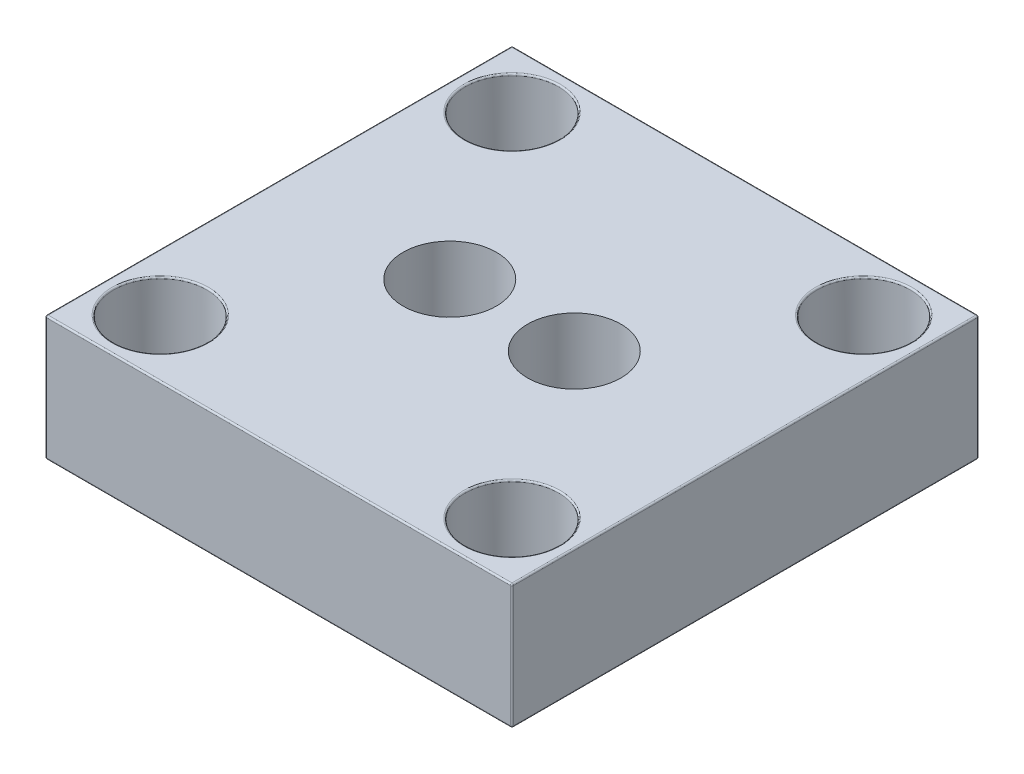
from build123d import *

# Parameters (mm, degrees)
SKETCH1_W           = 75
SKETCH1_H           = 75
BOSS_EXTRUDE1_DEPTH = 20
SKETCH2_R           = 4.5
CUT_EXTRUDE1_DEPTH  = 108.935165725
SKETCH3_R           = 7.5
CUT_EXTRUDE2_DEPTH  = 12
FILLET1_R           = 0.25
SKETCH4_R           = 7.5
CUT_EXTRUDE3_DEPTH  = 14


with BuildPart() as part:
    # Sketch1 → Boss-Extrude1 (new body)
    with BuildSketch(Plane(origin=(0, 0, 0), x_dir=(1, 0, 0), z_dir=(0, 1, 0))):
        with Locations((37.5, 37.5)):
            Rectangle(SKETCH1_W, SKETCH1_H)
    extrude(amount=BOSS_EXTRUDE1_DEPTH)

    # Sketch2 → Cut-Extrude1 (cut, through all)
    with BuildSketch(Plane(origin=(0, 20, 0), x_dir=(-1, 0, 0), z_dir=(0, 1, 0))):
        with Locations(Location((-27.5, -37.5, 0), (0, 0, 90))):
            Circle(SKETCH2_R)
        with Locations(Location((-9.25, -65.75, 0), (0, 0, 90))):
            Circle(SKETCH2_R)
        with Locations(Location((-9.25, -9.25, 0), (0, 0, 90))):
            Circle(SKETCH2_R)
        with Locations(Location((-65.75, -9.25, 0), (0, 0, 270))):
            Circle(SKETCH2_R)
        with Locations(Location((-47.5, -37.5, 0), (0, 0, 270))):
            Circle(SKETCH2_R)
        with Locations(Location((-65.75, -65.75, 0), (0, 0, 270))):
            Circle(SKETCH2_R)
    extrude(amount=-CUT_EXTRUDE1_DEPTH, mode=Mode.SUBTRACT)

    # Sketch3 → Cut-Extrude2 (cut)
    with BuildSketch(Plane(origin=(0, 20, 0), x_dir=(1, 0, 0), z_dir=(0, 1, 0))):
        with Locations(Location((65.75, 65.75, 0), (0, 0, 270))):
            Circle(SKETCH3_R)
        with Locations(Location((9.25, 65.75, 0), (0, 0, 270))):
            Circle(SKETCH3_R)
        with Locations(Location((9.25, 9.25, 0), (0, 0, 270))):
            Circle(SKETCH3_R)
        with Locations(Location((65.75, 9.25, 0), (0, 0, 270))):
            Circle(SKETCH3_R)
    extrude(amount=-CUT_EXTRUDE2_DEPTH, mode=Mode.SUBTRACT)

    # Fillet1
    fillet1_edges = [part.edges().sort_by_distance(p)[0] for p in [
        (75, 20, -37.5),
        (37.5, 20, -75),
        (27.5, 0, -42),
        (27.5, 20, -42),
        (9.25, 0, -70.25),
        (9.25, 0, -13.75),
        (65.75, 0, -4.75),
        (47.5, 0, -33),
        (47.5, 20, -33),
        (65.75, 0, -61.25),
        (0, 20, -37.5),
        (65.75, 20, -73.25),
        (37.5, 0, -75),
        (9.25, 20, -73.25),
        (75, 0, -37.5),
        (9.25, 20, -16.75),
        (37.5, 0, 0),
        (65.75, 20, -16.75),
        (0, 0, -37.5),
        (37.5, 20, 0),
        (0, 10, -75),
        (75, 10, -75),
        (75, 10, 0),
        (0, 10, 0),
    ]]
    fillet(fillet1_edges, radius=FILLET1_R)

    # Sketch4 → Cut-Extrude3 (cut)
    with BuildSketch(Plane(origin=(0, 20, 0), x_dir=(1, 0, 0), z_dir=(0, 1, 0))):
        with Locations(Location((27.5, 37.5, 0), (0, 0, 270))):
            Circle(SKETCH4_R)
        with Locations(Location((47.5, 37.5, 0), (0, 0, 270))):
            Circle(SKETCH4_R)
    extrude(amount=-CUT_EXTRUDE3_DEPTH, mode=Mode.SUBTRACT)


solid = part.part
